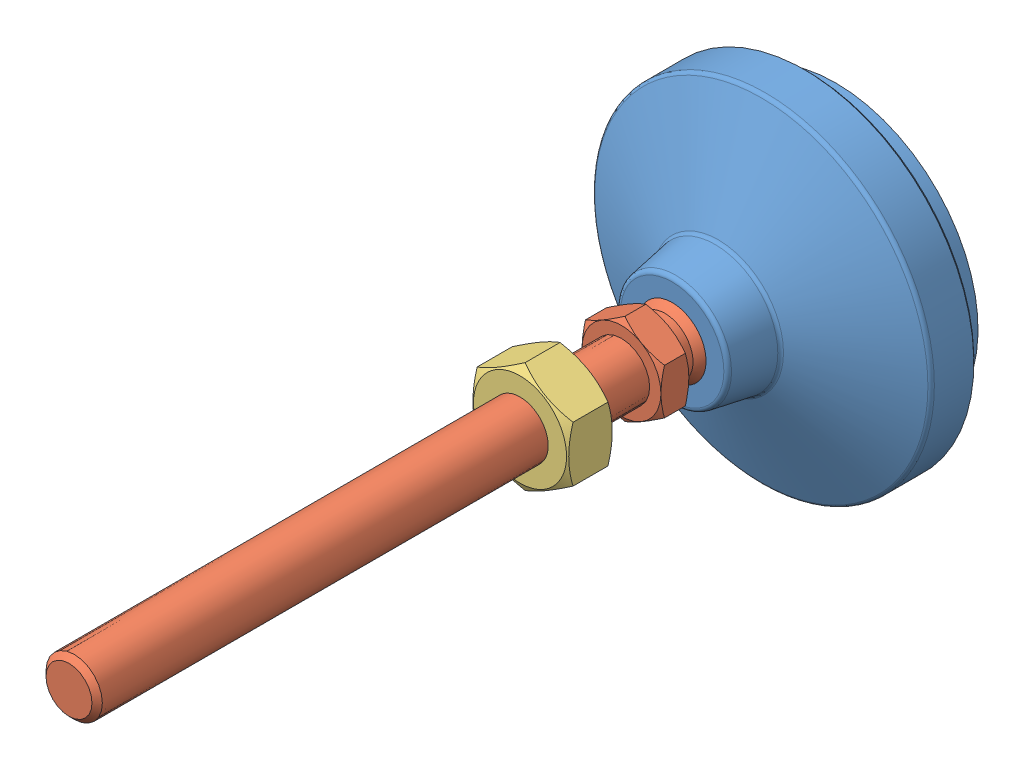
SolidWorks assembly LSVA50-M10X98-SUS.sldasm, configuration Default (file format 15000). Lengths in mm.
Overall size (60 60 136).
3 component instances, 3 part files, 0 mates.
Components (placement in the parent):
- LSVA50-M10X98-SUS_01-1: LSVA50-M10X98-SUS_01.sldprt [Default] at (0 0 5) x (1 0 0) z (0 -1 0) size (60 29 60)
- LSVA50-M10X98-SUS_02-1: LSVA50-M10X98-SUS_02.sldprt [Default] at (0 0 25.4) x (1 0 0) z (0 -1 0) size (14 117.6 16.17)
- LSVA50-M10X98-SUS_03-1: LSVA50-M10X98-SUS_03.sldprt [Default] at (0 0 48) size (17 19.63 8)
